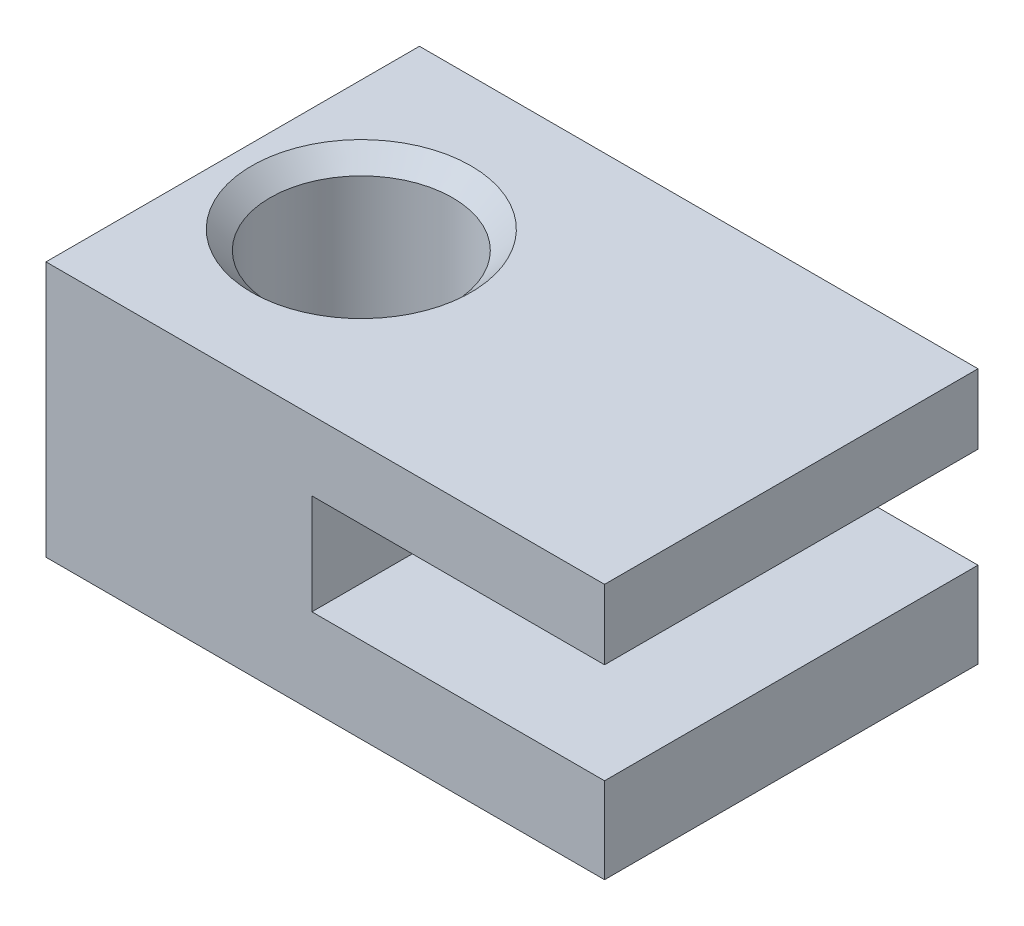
from build123d import *

# Parameters (mm, degrees)
SKETCH1_W      = 154.168044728
SKETCH1_H      = 103.072349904
EXTRUIR1_DEPTH = 70.612
SKETCH2_W      = 84.027333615
SKETCH2_H      = 27.714278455
CORTE1_DEPTH   = 155.279293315
SKETCH3_R      = 25.18218543
CORTE2_DEPTH   = 129.981056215
CHAFLAN1_SIZE  = 5.08


with BuildPart() as part:
    # Sketch1 → Extruir1 (new body)
    with BuildSketch(Plane(origin=(0, 0, 0), x_dir=(1, 0, 0), z_dir=(0, 1, 0))):
        with Locations((13.426399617, -7.267922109)):
            Rectangle(SKETCH1_W, SKETCH1_H)
    extrude(amount=EXTRUIR1_DEPTH)

    # Sketch2 → Corte1 (cut, through all)
    with BuildSketch(Plane.XY.offset(58.804097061)):
        with Locations((51.754657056, 37.517245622)):
            Rectangle(SKETCH2_W, SKETCH2_H)
    extrude(amount=-CORTE1_DEPTH, mode=Mode.SUBTRACT)

    # Sketch3 → Corte2 (cut, through all)
    with BuildSketch(Plane(origin=(0, 70.612, 0), x_dir=(-1, 0, 0), z_dir=(0, 1, 0))):
        with Locations(Location((27.971587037, 7.458696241, 0), (0, 0, 90))):
            Circle(SKETCH3_R)
    extrude(amount=-CORTE2_DEPTH, mode=Mode.SUBTRACT)

    # Chaflan1
    chaflan1_edges = [part.edges().sort_by_distance(p)[0] for p in [
        (-27.971587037, 70.612, -17.72348919),
    ]]
    chamfer(chaflan1_edges, length=CHAFLAN1_SIZE)


solid = part.part
